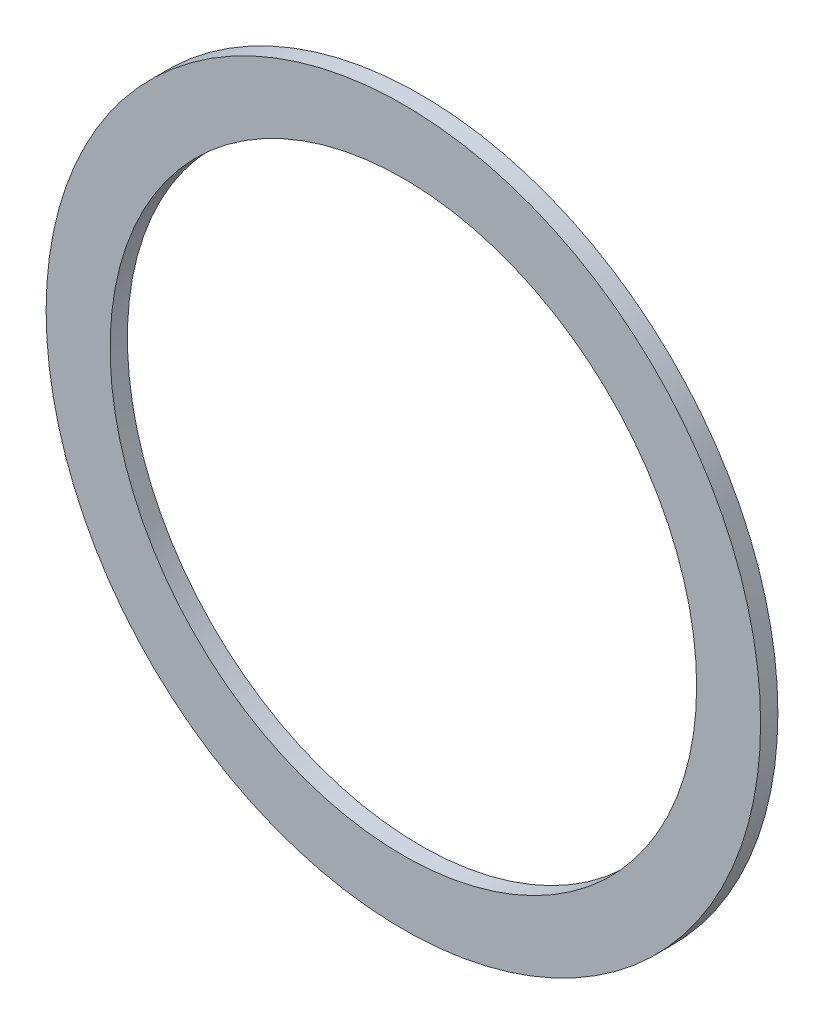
ISO-10303-21;
HEADER;
FILE_DESCRIPTION(('STEP AP214'),'2;1');
FILE_NAME('part.step','',(''),(''),'','','');
FILE_SCHEMA(('AUTOMOTIVE_DESIGN { 1 0 10303 214 1 1 1 1 }'));
ENDSEC;
DATA;
#1=APPLICATION_CONTEXT('core data for automotive mechanical design processes');
#2=APPLICATION_PROTOCOL_DEFINITION('international standard','automotive_design',2000,#1);
#3=PRODUCT_CONTEXT('',#1,'mechanical');
#4=PRODUCT('Part','Part','',(#3));
#5=PRODUCT_RELATED_PRODUCT_CATEGORY('part','',(#4));
#6=PRODUCT_DEFINITION_FORMATION('','',#4);
#7=PRODUCT_DEFINITION_CONTEXT('part definition',#1,'design');
#8=PRODUCT_DEFINITION('design','',#6,#7);
#9=PRODUCT_DEFINITION_SHAPE('','',#8);
#10=(LENGTH_UNIT() NAMED_UNIT(*) SI_UNIT(.MILLI.,.METRE.));
#11=(NAMED_UNIT(*) PLANE_ANGLE_UNIT() SI_UNIT($,.RADIAN.));
#12=(NAMED_UNIT(*) SI_UNIT($,.STERADIAN.) SOLID_ANGLE_UNIT());
#13=UNCERTAINTY_MEASURE_WITH_UNIT(LENGTH_MEASURE(1.E-05),#10,'distance_accuracy_value','');
#14=(GEOMETRIC_REPRESENTATION_CONTEXT(3) GLOBAL_UNCERTAINTY_ASSIGNED_CONTEXT((#13)) GLOBAL_UNIT_ASSIGNED_CONTEXT((#10,
#11,#12)) REPRESENTATION_CONTEXT('',''));
#15=CARTESIAN_POINT('',(0.,0.,0.));
#16=DIRECTION('',(0.,0.,1.));
#17=DIRECTION('',(1.,0.,0.));
#18=AXIS2_PLACEMENT_3D('',#15,#16,#17);
#19=CARTESIAN_POINT('',(0.,0.,-0.381));
#20=DIRECTION('',(0.,0.,1.));
#21=DIRECTION('',(1.,0.,0.));
#22=AXIS2_PLACEMENT_3D('',#19,#20,#21);
#23=CYLINDRICAL_SURFACE('',#22,7.874);
#24=CARTESIAN_POINT('',(0.,0.,-0.381));
#25=DIRECTION('',(0.,0.,1.));
#26=DIRECTION('',(1.,0.,0.));
#27=AXIS2_PLACEMENT_3D('',#24,#25,#26);
#28=CIRCLE('',#27,7.874);
#29=CARTESIAN_POINT('',(7.874,0.,-0.381));
#30=VERTEX_POINT('',#29);
#31=EDGE_CURVE('E10',#30,#30,#28,.T.);
#32=CARTESIAN_POINT('',(0.,0.,0.));
#33=DIRECTION('',(0.,0.,1.));
#34=DIRECTION('',(1.,0.,0.));
#35=AXIS2_PLACEMENT_3D('',#32,#33,#34);
#36=CIRCLE('',#35,7.874);
#37=CARTESIAN_POINT('',(7.874,0.,0.));
#38=VERTEX_POINT('',#37);
#39=EDGE_CURVE('E34',#38,#38,#36,.T.);
#40=CARTESIAN_POINT('',(7.874,0.,-0.381));
#41=CARTESIAN_POINT('',(7.874,0.,-0.37703125));
#42=CARTESIAN_POINT('',(7.874,0.,-0.3730625));
#43=CARTESIAN_POINT('',(7.874,0.,-0.365125));
#44=CARTESIAN_POINT('',(7.874,0.,-0.36115625));
#45=CARTESIAN_POINT('',(7.874,0.,-0.35321875));
#46=CARTESIAN_POINT('',(7.874,0.,-0.34925));
#47=CARTESIAN_POINT('',(7.874,0.,-0.3413125));
#48=CARTESIAN_POINT('',(7.874,0.,-0.33734375));
#49=CARTESIAN_POINT('',(7.874,0.,-0.32940625));
#50=CARTESIAN_POINT('',(7.874,0.,-0.3254375));
#51=CARTESIAN_POINT('',(7.874,0.,-0.3175));
#52=CARTESIAN_POINT('',(7.874,0.,-0.31353125));
#53=CARTESIAN_POINT('',(7.874,0.,-0.30559375));
#54=CARTESIAN_POINT('',(7.874,0.,-0.301625));
#55=CARTESIAN_POINT('',(7.874,0.,-0.2936875));
#56=CARTESIAN_POINT('',(7.874,0.,-0.28971875));
#57=CARTESIAN_POINT('',(7.874,0.,-0.28178125));
#58=CARTESIAN_POINT('',(7.874,0.,-0.2778125));
#59=CARTESIAN_POINT('',(7.874,0.,-0.269875));
#60=CARTESIAN_POINT('',(7.874,0.,-0.26590625));
#61=CARTESIAN_POINT('',(7.874,0.,-0.25796875));
#62=CARTESIAN_POINT('',(7.874,0.,-0.254));
#63=CARTESIAN_POINT('',(7.874,0.,-0.2460625));
#64=CARTESIAN_POINT('',(7.874,0.,-0.24209375));
#65=CARTESIAN_POINT('',(7.874,0.,-0.23415625));
#66=CARTESIAN_POINT('',(7.874,0.,-0.2301875));
#67=CARTESIAN_POINT('',(7.874,0.,-0.22225));
#68=CARTESIAN_POINT('',(7.874,0.,-0.21828125));
#69=CARTESIAN_POINT('',(7.874,0.,-0.21034375));
#70=CARTESIAN_POINT('',(7.874,0.,-0.206375));
#71=CARTESIAN_POINT('',(7.874,0.,-0.1984375));
#72=CARTESIAN_POINT('',(7.874,0.,-0.19446875));
#73=CARTESIAN_POINT('',(7.874,0.,-0.18653125));
#74=CARTESIAN_POINT('',(7.874,0.,-0.1825625));
#75=CARTESIAN_POINT('',(7.874,0.,-0.174625));
#76=CARTESIAN_POINT('',(7.874,0.,-0.17065625));
#77=CARTESIAN_POINT('',(7.874,0.,-0.16271875));
#78=CARTESIAN_POINT('',(7.874,0.,-0.15875));
#79=CARTESIAN_POINT('',(7.874,0.,-0.1508125));
#80=CARTESIAN_POINT('',(7.874,0.,-0.14684375));
#81=CARTESIAN_POINT('',(7.874,0.,-0.13890625));
#82=CARTESIAN_POINT('',(7.874,0.,-0.1349375));
#83=CARTESIAN_POINT('',(7.874,0.,-0.127));
#84=CARTESIAN_POINT('',(7.874,0.,-0.12303125));
#85=CARTESIAN_POINT('',(7.874,0.,-0.11509375));
#86=CARTESIAN_POINT('',(7.874,0.,-0.111125));
#87=CARTESIAN_POINT('',(7.874,0.,-0.1031875));
#88=CARTESIAN_POINT('',(7.874,0.,-0.09921875));
#89=CARTESIAN_POINT('',(7.874,0.,-0.09128125));
#90=CARTESIAN_POINT('',(7.874,0.,-0.0873125));
#91=CARTESIAN_POINT('',(7.874,0.,-0.079375));
#92=CARTESIAN_POINT('',(7.874,0.,-0.07540625));
#93=CARTESIAN_POINT('',(7.874,0.,-0.06746875));
#94=CARTESIAN_POINT('',(7.874,0.,-0.0635));
#95=CARTESIAN_POINT('',(7.874,0.,-0.0555625));
#96=CARTESIAN_POINT('',(7.874,0.,-0.05159375));
#97=CARTESIAN_POINT('',(7.874,0.,-0.04365625));
#98=CARTESIAN_POINT('',(7.874,0.,-0.0396875));
#99=CARTESIAN_POINT('',(7.874,0.,-0.03175));
#100=CARTESIAN_POINT('',(7.874,0.,-0.02778125));
#101=CARTESIAN_POINT('',(7.874,0.,-0.01984375));
#102=CARTESIAN_POINT('',(7.874,0.,-0.015875));
#103=CARTESIAN_POINT('',(7.874,0.,-0.00793749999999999));
#104=CARTESIAN_POINT('',(7.874,0.,-0.00396874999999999));
#105=CARTESIAN_POINT('',(7.874,0.,0.));
#106=B_SPLINE_CURVE_WITH_KNOTS('',3,(#40,#41,#42,#43,#44,#45,#46,#47,#48,#49,#50,#51,#52,#53,
#54,#55,#56,#57,#58,#59,#60,#61,#62,#63,#64,#65,#66,#67,#68,#69,#70,#71,#72,#73,#74,#75,#76,#77,
#78,#79,#80,#81,#82,#83,#84,#85,#86,#87,#88,#89,#90,#91,#92,#93,#94,#95,#96,#97,#98,#99,#100,
#101,#102,#103,#104,#105),.UNSPECIFIED.,.F.,.F.,(4,2,2,2,2,2,2,2,2,2,2,2,2,2,2,2,2,2,2,2,2,2,2,
2,2,2,2,2,2,2,2,2,4),(0.,0.01190625,0.0238125,0.03571875,0.047625,0.05953125,0.0714374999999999,
0.08334375,0.09525,0.10715625,0.1190625,0.13096875,0.142875,0.15478125,0.1666875,0.17859375,
0.1905,0.20240625,0.2143125,0.22621875,0.238125,0.25003125,0.2619375,0.27384375,0.28575,
0.29765625,0.3095625,0.32146875,0.333375,0.34528125,0.3571875,0.36909375,0.381),.UNSPECIFIED.);
#107=EDGE_CURVE('BSEAM31',#30,#38,#106,.T.);
#108=ORIENTED_EDGE('',*,*,#31,.T.);
#109=ORIENTED_EDGE('',*,*,#39,.F.);
#110=ORIENTED_EDGE('',*,*,#107,.T.);
#111=ORIENTED_EDGE('',*,*,#107,.F.);
#112=EDGE_LOOP('',(#108,#110,#109,#111));
#113=FACE_BOUND('',#112,.T.);
#114=ADVANCED_FACE('F31',(#113),#23,.T.);
#115=CARTESIAN_POINT('',(0.,0.,-0.381));
#116=DIRECTION('',(0.,0.,1.));
#117=DIRECTION('',(1.,0.,0.));
#118=AXIS2_PLACEMENT_3D('',#115,#116,#117);
#119=PLANE('',#118);
#120=CARTESIAN_POINT('',(0.,0.,-0.381));
#121=DIRECTION('',(0.,0.,1.));
#122=DIRECTION('',(1.,0.,0.));
#123=AXIS2_PLACEMENT_3D('',#120,#121,#122);
#124=CIRCLE('',#123,6.4643);
#125=CARTESIAN_POINT('',(6.4643,0.,-0.381));
#126=VERTEX_POINT('',#125);
#127=EDGE_CURVE('E41',#126,#126,#124,.T.);
#128=ORIENTED_EDGE('',*,*,#127,.T.);
#129=EDGE_LOOP('',(#128));
#130=FACE_BOUND('',#129,.T.);
#131=ORIENTED_EDGE('',*,*,#31,.F.);
#132=EDGE_LOOP('',(#131));
#133=FACE_BOUND('',#132,.T.);
#134=ADVANCED_FACE('F49',(#130,#133),#119,.F.);
#135=CARTESIAN_POINT('',(0.,0.,0.));
#136=DIRECTION('',(0.,0.,1.));
#137=DIRECTION('',(1.,0.,0.));
#138=AXIS2_PLACEMENT_3D('',#135,#136,#137);
#139=PLANE('',#138);
#140=CARTESIAN_POINT('',(0.,0.,0.));
#141=DIRECTION('',(0.,0.,1.));
#142=DIRECTION('',(1.,0.,0.));
#143=AXIS2_PLACEMENT_3D('',#140,#141,#142);
#144=CIRCLE('',#143,6.4643);
#145=CARTESIAN_POINT('',(6.4643,0.,0.));
#146=VERTEX_POINT('',#145);
#147=EDGE_CURVE('E43',#146,#146,#144,.T.);
#148=ORIENTED_EDGE('',*,*,#147,.F.);
#149=EDGE_LOOP('',(#148));
#150=FACE_BOUND('',#149,.T.);
#151=ORIENTED_EDGE('',*,*,#39,.T.);
#152=EDGE_LOOP('',(#151));
#153=FACE_BOUND('',#152,.T.);
#154=ADVANCED_FACE('F55',(#150,#153),#139,.T.);
#155=CARTESIAN_POINT('',(0.,0.,-0.381));
#156=DIRECTION('',(0.,0.,1.));
#157=DIRECTION('',(1.,0.,0.));
#158=AXIS2_PLACEMENT_3D('',#155,#156,#157);
#159=CYLINDRICAL_SURFACE('',#158,6.4643);
#160=CARTESIAN_POINT('',(6.4643,0.,-0.381));
#161=CARTESIAN_POINT('',(6.4643,0.,-0.37703125));
#162=CARTESIAN_POINT('',(6.4643,0.,-0.3730625));
#163=CARTESIAN_POINT('',(6.4643,0.,-0.365125));
#164=CARTESIAN_POINT('',(6.4643,0.,-0.36115625));
#165=CARTESIAN_POINT('',(6.4643,0.,-0.35321875));
#166=CARTESIAN_POINT('',(6.4643,0.,-0.34925));
#167=CARTESIAN_POINT('',(6.4643,0.,-0.3413125));
#168=CARTESIAN_POINT('',(6.4643,0.,-0.33734375));
#169=CARTESIAN_POINT('',(6.4643,0.,-0.32940625));
#170=CARTESIAN_POINT('',(6.4643,0.,-0.3254375));
#171=CARTESIAN_POINT('',(6.4643,0.,-0.3175));
#172=CARTESIAN_POINT('',(6.4643,0.,-0.31353125));
#173=CARTESIAN_POINT('',(6.4643,0.,-0.30559375));
#174=CARTESIAN_POINT('',(6.4643,0.,-0.301625));
#175=CARTESIAN_POINT('',(6.4643,0.,-0.2936875));
#176=CARTESIAN_POINT('',(6.4643,0.,-0.28971875));
#177=CARTESIAN_POINT('',(6.4643,0.,-0.28178125));
#178=CARTESIAN_POINT('',(6.4643,0.,-0.2778125));
#179=CARTESIAN_POINT('',(6.4643,0.,-0.269875));
#180=CARTESIAN_POINT('',(6.4643,0.,-0.26590625));
#181=CARTESIAN_POINT('',(6.4643,0.,-0.25796875));
#182=CARTESIAN_POINT('',(6.4643,0.,-0.254));
#183=CARTESIAN_POINT('',(6.4643,0.,-0.2460625));
#184=CARTESIAN_POINT('',(6.4643,0.,-0.24209375));
#185=CARTESIAN_POINT('',(6.4643,0.,-0.23415625));
#186=CARTESIAN_POINT('',(6.4643,0.,-0.2301875));
#187=CARTESIAN_POINT('',(6.4643,0.,-0.22225));
#188=CARTESIAN_POINT('',(6.4643,0.,-0.21828125));
#189=CARTESIAN_POINT('',(6.4643,0.,-0.21034375));
#190=CARTESIAN_POINT('',(6.4643,0.,-0.206375));
#191=CARTESIAN_POINT('',(6.4643,0.,-0.1984375));
#192=CARTESIAN_POINT('',(6.4643,0.,-0.19446875));
#193=CARTESIAN_POINT('',(6.4643,0.,-0.18653125));
#194=CARTESIAN_POINT('',(6.4643,0.,-0.1825625));
#195=CARTESIAN_POINT('',(6.4643,0.,-0.174625));
#196=CARTESIAN_POINT('',(6.4643,0.,-0.17065625));
#197=CARTESIAN_POINT('',(6.4643,0.,-0.16271875));
#198=CARTESIAN_POINT('',(6.4643,0.,-0.15875));
#199=CARTESIAN_POINT('',(6.4643,0.,-0.1508125));
#200=CARTESIAN_POINT('',(6.4643,0.,-0.14684375));
#201=CARTESIAN_POINT('',(6.4643,0.,-0.13890625));
#202=CARTESIAN_POINT('',(6.4643,0.,-0.1349375));
#203=CARTESIAN_POINT('',(6.4643,0.,-0.127));
#204=CARTESIAN_POINT('',(6.4643,0.,-0.12303125));
#205=CARTESIAN_POINT('',(6.4643,0.,-0.11509375));
#206=CARTESIAN_POINT('',(6.4643,0.,-0.111125));
#207=CARTESIAN_POINT('',(6.4643,0.,-0.1031875));
#208=CARTESIAN_POINT('',(6.4643,0.,-0.09921875));
#209=CARTESIAN_POINT('',(6.4643,0.,-0.09128125));
#210=CARTESIAN_POINT('',(6.4643,0.,-0.0873125));
#211=CARTESIAN_POINT('',(6.4643,0.,-0.079375));
#212=CARTESIAN_POINT('',(6.4643,0.,-0.07540625));
#213=CARTESIAN_POINT('',(6.4643,0.,-0.06746875));
#214=CARTESIAN_POINT('',(6.4643,0.,-0.0635));
#215=CARTESIAN_POINT('',(6.4643,0.,-0.0555625));
#216=CARTESIAN_POINT('',(6.4643,0.,-0.05159375));
#217=CARTESIAN_POINT('',(6.4643,0.,-0.04365625));
#218=CARTESIAN_POINT('',(6.4643,0.,-0.0396875));
#219=CARTESIAN_POINT('',(6.4643,0.,-0.03175));
#220=CARTESIAN_POINT('',(6.4643,0.,-0.02778125));
#221=CARTESIAN_POINT('',(6.4643,0.,-0.01984375));
#222=CARTESIAN_POINT('',(6.4643,0.,-0.015875));
#223=CARTESIAN_POINT('',(6.4643,0.,-0.00793749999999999));
#224=CARTESIAN_POINT('',(6.4643,0.,-0.00396874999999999));
#225=CARTESIAN_POINT('',(6.4643,0.,0.));
#226=B_SPLINE_CURVE_WITH_KNOTS('',3,(#160,#161,#162,#163,#164,#165,#166,#167,#168,#169,#170,
#171,#172,#173,#174,#175,#176,#177,#178,#179,#180,#181,#182,#183,#184,#185,#186,#187,#188,#189,
#190,#191,#192,#193,#194,#195,#196,#197,#198,#199,#200,#201,#202,#203,#204,#205,#206,#207,#208,
#209,#210,#211,#212,#213,#214,#215,#216,#217,#218,#219,#220,#221,#222,#223,#224,#225),
.UNSPECIFIED.,.F.,.F.,(4,2,2,2,2,2,2,2,2,2,2,2,2,2,2,2,2,2,2,2,2,2,2,2,2,2,2,2,2,2,2,2,4),(0.,
0.01190625,0.0238125,0.03571875,0.047625,0.05953125,0.0714375,0.08334375,0.0952500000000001,
0.10715625,0.1190625,0.13096875,0.142875,0.15478125,0.1666875,0.17859375,0.1905,0.20240625,
0.2143125,0.22621875,0.238125,0.25003125,0.2619375,0.27384375,0.28575,0.29765625,0.3095625,
0.32146875,0.333375,0.34528125,0.3571875,0.36909375,0.381),.UNSPECIFIED.);
#227=EDGE_CURVE('BSEAM52',#126,#146,#226,.T.);
#228=ORIENTED_EDGE('',*,*,#127,.F.);
#229=ORIENTED_EDGE('',*,*,#147,.T.);
#230=ORIENTED_EDGE('',*,*,#227,.T.);
#231=ORIENTED_EDGE('',*,*,#227,.F.);
#232=EDGE_LOOP('',(#228,#230,#229,#231));
#233=FACE_BOUND('',#232,.T.);
#234=ADVANCED_FACE('F52',(#233),#159,.F.);
#235=CLOSED_SHELL('',(#114,#134,#154,#234));
#236=MANIFOLD_SOLID_BREP('B2',#235);
#237=ADVANCED_BREP_SHAPE_REPRESENTATION('',(#18,#236),#14);
#238=SHAPE_DEFINITION_REPRESENTATION(#9,#237);
ENDSEC;
END-ISO-10303-21;
